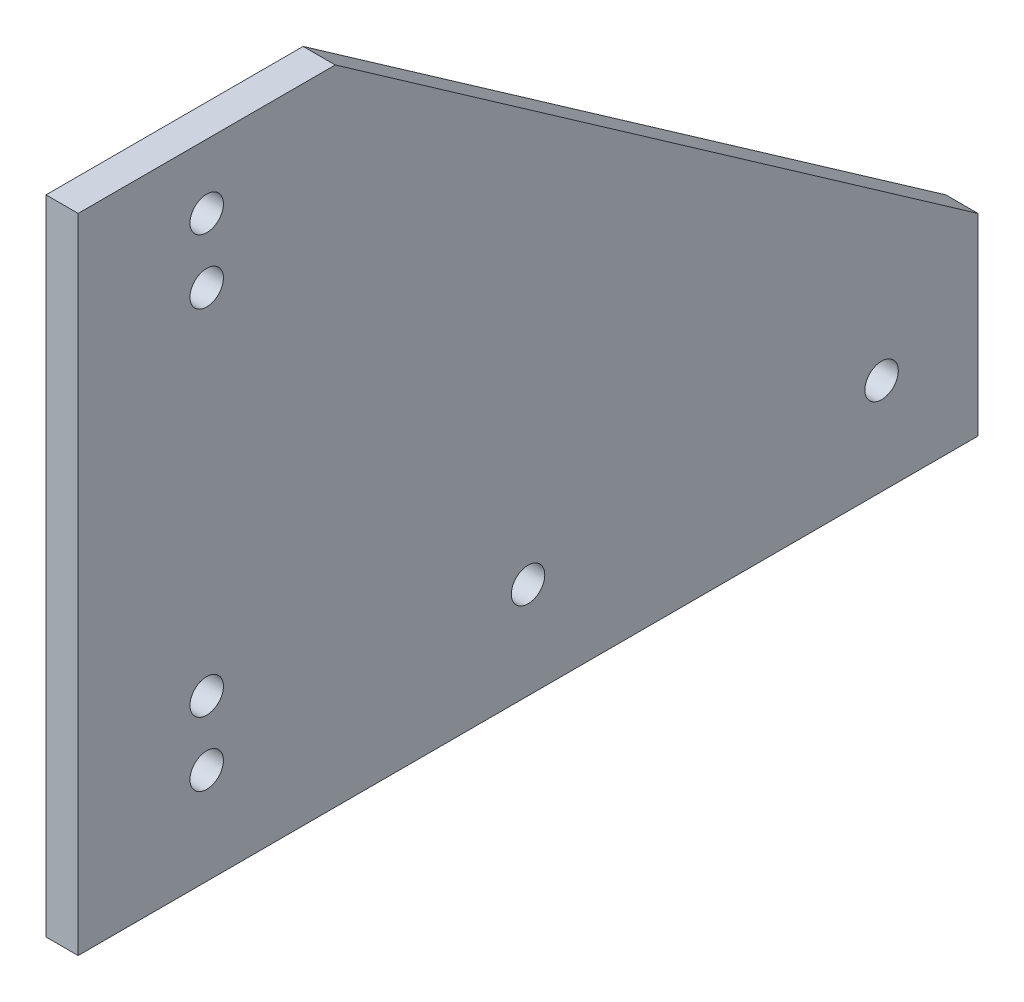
from build123d import *

# Parameters (mm, degrees)
BOSS_EXTRUDE1_DEPTH = 6.35
SKETCH2_R           = 3.302
BOLTS_DEPTH         = 219.591313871


with BuildPart() as part:
    # Sketch1 → Boss-Extrude1 (new body)
    with BuildSketch(Plane(origin=(0, 0, 0), x_dir=(0, 0, -1), z_dir=(1, 0, 0))):
        Polygon((0, 0), (0, 127), (50.8, 127), (177.8, 38.1), (177.8, 0), align=None)
    extrude(amount=BOSS_EXTRUDE1_DEPTH)

    # Sketch2 → bolts (cut, through all)
    with BuildSketch(Plane(origin=(6.35, 0, 0), x_dir=(0, 0, -1), z_dir=(1, 0, 0))):
        with Locations((25.4, 114.3)):
            Circle(SKETCH2_R)
        with Locations((25.4, 101.6)):
            Circle(SKETCH2_R)
        with Locations((25.4, 19.05)):
            Circle(SKETCH2_R)
        with Locations((25.4, 31.75)):
            Circle(SKETCH2_R)
        with Locations((158.75, 19.05)):
            Circle(SKETCH2_R)
        with Locations((88.9, 19.05)):
            Circle(SKETCH2_R)
    extrude(amount=-BOLTS_DEPTH, mode=Mode.SUBTRACT)


solid = part.part
